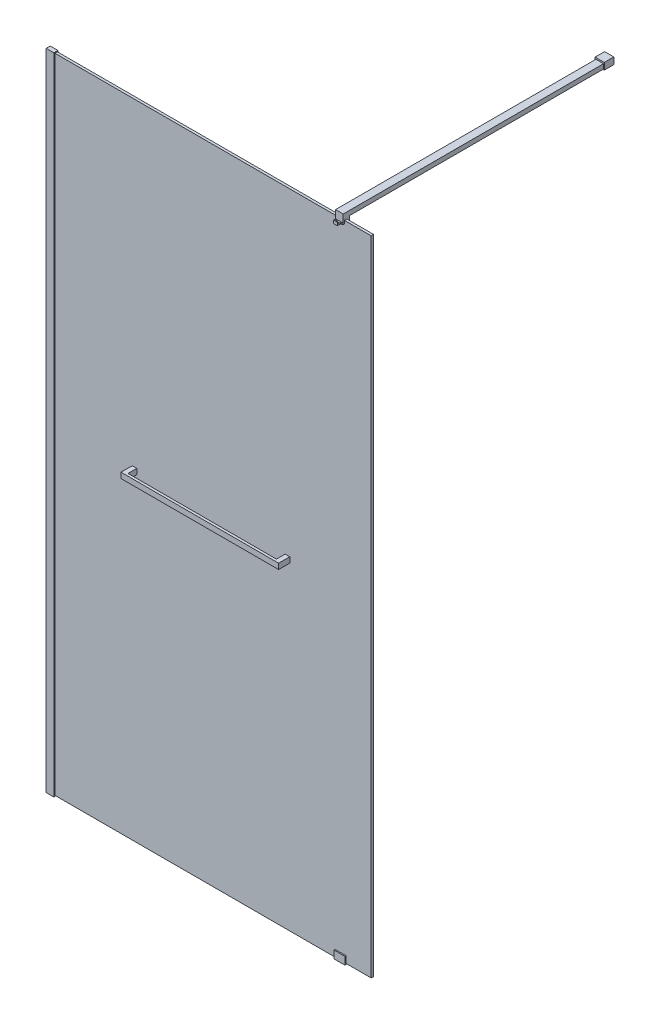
from build123d import *

# Parameters (mm, degrees)
DODANIE_WYCI_GNI_CIE1_DEPTH     = 2100
SZKIC2_W                        = 1047
SZKIC2_H                        = 8
DODANIE_WYCI_GNI_CIE2_DEPTH     = 2100
SZKIC4_W                        = 25
SZKIC4_H                        = 13.3
DODANIE_WYCI_GNI_CIE3_DEPTH     = 3
SZKIC5_W                        = 25
SZKIC5_H                        = 13.3
DODANIE_WYCI_GNI_CIE4_DEPTH     = 3
DODANIE_WYCI_GNI_CIE5_DEPTH     = 17.5
DODANIE_WYCI_GNI_CIE6_DEPTH     = 12.5
WYTNIJ_WYCI_GNI_CIE1_DEPTH      = 2355.421746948
WYTNIJ_WYCI_GNI_CIE1_DEPTH_BACK = 2355.421746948
SZKIC10_W                       = 25
SZKIC10_H                       = 861.63
DODANIE_WYCI_GNI_CIE7_DEPTH     = 15
SZKIC14_W                       = 30
SZKIC14_H                       = 22
DODANIE_WYCI_GNI_CIE8_DEPTH     = 31
POLKA_1A_DEPTH                  = 36.5
POLKA_1A_DEPTH_BACK             = 31
SZKIC17_W                       = 15
SZKIC17_H                       = 18
POLKA_1A_2_DEPTH                = 36.5
POLKA_1A_2_DEPTH_BACK           = 31
POLKA_1B_START                  = -515
SZKIC18_W                       = 12.8
SZKIC18_H                       = 8
POLKA_1B_DEPTH                  = 515
POLKA_1C_START                  = -5.28
SZKIC19_W                       = 515
SZKIC19_H                       = 80
POLKA_1C_DEPTH                  = 8
SZKIC20_W                       = 8
SZKIC20_H                       = 18
POLKA_1D_DEPTH                  = 485


with BuildPart() as part:
    # Szkic1 → Dodanie-wyci_gni_cie1 (new body)
    with BuildSketch(Plane(origin=(0, 0, 0), x_dir=(1, 0, 0), z_dir=(0, 1, 0))):
        Polygon((0, 0), (0, 13.3), (25, 13.3), (25, 11.4), (11.45, 11.4), (11.45, 3.4), (25, 3.4), (25, 0), align=None)
    extrude(amount=DODANIE_WYCI_GNI_CIE1_DEPTH)

    # Szkic4 → Dodanie-wyci_gni_cie3 (add)
    with BuildSketch(Plane(origin=(0, 2100, 0), x_dir=(1, 0, 0), z_dir=(0, 1, 0))):
        with Locations((12.5, 6.65)):
            Rectangle(SZKIC4_W, SZKIC4_H)
    extrude(amount=DODANIE_WYCI_GNI_CIE3_DEPTH)

    # Szkic5 → Dodanie-wyci_gni_cie4 (add)
    with BuildSketch(Plane.XZ):
        with Locations((12.5, -6.65)):
            Rectangle(SZKIC5_W, SZKIC5_H)
    extrude(amount=DODANIE_WYCI_GNI_CIE4_DEPTH)


with BuildPart() as body_2:
    # Szkic2 → Dodanie-wyci_gni_cie2 (new body)
    with BuildSketch(Plane.XZ):
        with Locations((534.95, -7.4)):
            Rectangle(SZKIC2_W, SZKIC2_H)
    extrude(amount=-DODANIE_WYCI_GNI_CIE2_DEPTH)


with BuildPart() as body_3:
    # Szkic6 → Dodanie-wyci_gni_cie5 (new, symmetric)
    with BuildSketch(Plane(origin=(958.45, 0, 0), x_dir=(0, 0, -1), z_dir=(1, 0, 0))):
        Polygon((11.4, 22), (15.75, 22), (15.75, -3), (-0.35, -3), (-0.35, 22), (3.4, 22), (3.4, 0), (11.4, 0), align=None)
    extrude(amount=DODANIE_WYCI_GNI_CIE5_DEPTH, both=True)


with BuildPart() as body_4:
    # Szkic7 → Dodanie-wyci_gni_cie6 (new, symmetric)
    with BuildSketch(Plane(origin=(958.45, 0, 0), x_dir=(0, 0, -1), z_dir=(1, 0, 0))):
        Polygon((-0.6, 2120), (19.4, 2120), (19.4, 2090), (11.4, 2090), (11.4, 2100), (3.4, 2100), (3.4, 2090), (-13.37, 2090), (-13.37, 2100), (-10.37, 2100), (-9.845068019, 2094), (-0.6, 2094), align=None)
    extrude(amount=DODANIE_WYCI_GNI_CIE6_DEPTH, both=True)

    # Szkic8 → Wytnij-wyci_gni_cie1 (cut, two sides: drawn at the far end of the back side and taken through both)
    with BuildSketch(Plane(origin=(0, 2100, 0), x_dir=(1, 0, 0), z_dir=(0, 1, 0)).offset(-WYTNIJ_WYCI_GNI_CIE1_DEPTH_BACK)):
        Polygon((-823.445499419, 824.482671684), (945.95, -0.6), (952.45, -3.630999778), (952.45, -13.37), (964.45, -13.37), (964.45, -3.630999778), (970.95, -0.6), (2740.345499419, 824.482671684), (2740.345499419, -3080.141176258), (-823.445499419, -3080.141176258), align=None)
    extrude(amount=WYTNIJ_WYCI_GNI_CIE1_DEPTH + WYTNIJ_WYCI_GNI_CIE1_DEPTH_BACK, mode=Mode.SUBTRACT)

    # Szkic10 → Dodanie-wyci_gni_cie7 (add)
    with BuildSketch(Plane(origin=(0, 2120, 0), x_dir=(1, 0, 0), z_dir=(0, 1, 0))):
        with Locations((958.45, 450.215)):
            Rectangle(SZKIC10_W, SZKIC10_H)
    extrude(amount=-DODANIE_WYCI_GNI_CIE7_DEPTH)

    # Szkic14 → Dodanie-wyci_gni_cie8 (add)
    with BuildSketch(Plane(origin=(0, 0, -881.03), x_dir=(-1, 0, 0), z_dir=(0, 0, -1))):
        with Locations((-958.45, 2114)):
            Rectangle(SZKIC14_W, SZKIC14_H)
    extrude(amount=-DODANIE_WYCI_GNI_CIE8_DEPTH)


with BuildPart() as body_5:
    # Szkic17 → polka_1a (new, two sides: drawn at the far end of the back side and taken through both)
    with BuildSketch(Plane.XY.offset(-3.4).offset(-POLKA_1A_DEPTH_BACK)):
        with Locations((284.95, 1050)):
            Rectangle(SZKIC17_W, SZKIC17_H)
    extrude(amount=POLKA_1A_DEPTH + POLKA_1A_DEPTH_BACK)


with BuildPart() as body_6:
    # Szkic17 → polka_1a 2 (new, two sides: drawn at the far end of the back side and taken through both)
    with BuildSketch(Plane.XY.offset(-3.4).offset(-POLKA_1A_2_DEPTH_BACK)):
        with Locations((784.95, 1050)):
            Rectangle(SZKIC17_W, SZKIC17_H)
    extrude(amount=POLKA_1A_2_DEPTH + POLKA_1A_2_DEPTH_BACK)


with BuildPart() as polka_1b_tool:
    # Szkic18 → polka_1b (new body)
    with BuildSketch(Plane.ZY.offset(-277.45).offset(POLKA_1B_START)):
        with Locations((-28, 1049.73)):
            Rectangle(SZKIC18_W, SZKIC18_H)
    extrude(amount=POLKA_1B_DEPTH)


with BuildPart() as body_5_1:
    add(body_5.part)

    # polka_1b: cut by polka_1b_tool
    add(polka_1b_tool.part, mode=Mode.SUBTRACT)



with BuildPart() as body_6_1:
    add(body_6.part)

    # polka_1b: cut by polka_1b_tool
    add(polka_1b_tool.part, mode=Mode.SUBTRACT)


with BuildPart() as body_7:
    # Szkic19 → polka_1c (new body)
    with BuildSketch(Plane(origin=(0, 1059, 0), x_dir=(1, 0, 0), z_dir=(0, 1, 0)).offset(POLKA_1C_START)):
        with Locations((534.95, 61.6)):
            Rectangle(SZKIC19_W, SZKIC19_H)
    extrude(amount=-POLKA_1C_DEPTH)


with BuildPart() as body_5_2:
    add(body_5_1.part)

    add(body_6_1.part)  # polka_1d merges body 6
    # Szkic20 → polka_1d (add)
    with BuildSketch(Plane(origin=(292.45, 0, 0), x_dir=(0, 0, -1), z_dir=(1, 0, 0))):
        with Locations((-29.1, 1050)):
            Rectangle(SZKIC20_W, SZKIC20_H)
    extrude(amount=POLKA_1D_DEPTH)


solid = Compound([part.part, body_2.part, body_3.part, body_4.part, body_7.part, body_5_2.part])
